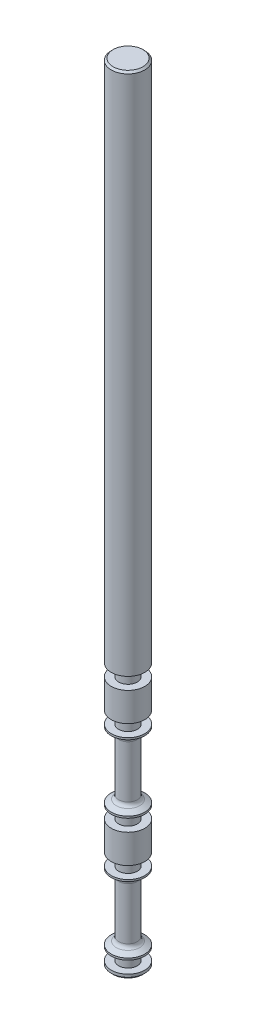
ISO-10303-21;
HEADER;
FILE_DESCRIPTION(('STEP AP214'),'2;1');
FILE_NAME('part.step','',(''),(''),'','','');
FILE_SCHEMA(('AUTOMOTIVE_DESIGN { 1 0 10303 214 1 1 1 1 }'));
ENDSEC;
DATA;
#1=APPLICATION_CONTEXT('core data for automotive mechanical design processes');
#2=APPLICATION_PROTOCOL_DEFINITION('international standard','automotive_design',2000,#1);
#3=PRODUCT_CONTEXT('',#1,'mechanical');
#4=PRODUCT('Part','Part','',(#3));
#5=PRODUCT_RELATED_PRODUCT_CATEGORY('part','',(#4));
#6=PRODUCT_DEFINITION_FORMATION('','',#4);
#7=PRODUCT_DEFINITION_CONTEXT('part definition',#1,'design');
#8=PRODUCT_DEFINITION('design','',#6,#7);
#9=PRODUCT_DEFINITION_SHAPE('','',#8);
#10=(LENGTH_UNIT() NAMED_UNIT(*) SI_UNIT(.MILLI.,.METRE.));
#11=(NAMED_UNIT(*) PLANE_ANGLE_UNIT() SI_UNIT($,.RADIAN.));
#12=(NAMED_UNIT(*) SI_UNIT($,.STERADIAN.) SOLID_ANGLE_UNIT());
#13=UNCERTAINTY_MEASURE_WITH_UNIT(LENGTH_MEASURE(1.E-05),#10,'distance_accuracy_value','');
#14=(GEOMETRIC_REPRESENTATION_CONTEXT(3) GLOBAL_UNCERTAINTY_ASSIGNED_CONTEXT((#13)) GLOBAL_UNIT_ASSIGNED_CONTEXT((#10,
#11,#12)) REPRESENTATION_CONTEXT('',''));
#15=CARTESIAN_POINT('',(0.,0.,0.));
#16=DIRECTION('',(0.,0.,1.));
#17=DIRECTION('',(1.,0.,0.));
#18=AXIS2_PLACEMENT_3D('',#15,#16,#17);
#19=CARTESIAN_POINT('',(56.,-1067.65754338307,0.5));
#20=DIRECTION('',(0.,-1.,0.));
#21=DIRECTION('',(0.,0.,-1.));
#22=AXIS2_PLACEMENT_3D('',#19,#20,#21);
#23=CYLINDRICAL_SURFACE('',#22,1.80000000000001);
#24=CARTESIAN_POINT('',(56.,-59.9499999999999,0.5));
#25=DIRECTION('',(0.,-1.,0.));
#26=DIRECTION('',(0.,0.,-1.));
#27=AXIS2_PLACEMENT_3D('',#24,#25,#26);
#28=CIRCLE('',#27,1.80000000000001);
#29=CARTESIAN_POINT('',(56.,-59.9499999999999,-1.30000000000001));
#30=VERTEX_POINT('',#29);
#31=EDGE_CURVE('E144',#30,#30,#28,.T.);
#32=ORIENTED_EDGE('',*,*,#31,.T.);
#33=EDGE_LOOP('',(#32));
#34=FACE_BOUND('',#33,.T.);
#35=CARTESIAN_POINT('',(56.,-63.0500000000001,0.5));
#36=DIRECTION('',(0.,-1.,0.));
#37=DIRECTION('',(0.,0.,-1.));
#38=AXIS2_PLACEMENT_3D('',#35,#36,#37);
#39=CIRCLE('',#38,1.80000000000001);
#40=CARTESIAN_POINT('',(56.,-63.0500000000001,-1.30000000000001));
#41=VERTEX_POINT('',#40);
#42=EDGE_CURVE('E75',#41,#41,#39,.T.);
#43=ORIENTED_EDGE('',*,*,#42,.F.);
#44=EDGE_LOOP('',(#43));
#45=FACE_BOUND('',#44,.T.);
#46=ADVANCED_FACE('F31',(#34,#45),#23,.T.);
#47=CARTESIAN_POINT('',(57.8,-63.05,0.5));
#48=DIRECTION('',(0.,-1.,0.));
#49=DIRECTION('',(0.,0.,-1.));
#50=AXIS2_PLACEMENT_3D('',#47,#48,#49);
#51=PLANE('',#50);
#52=ORIENTED_EDGE('',*,*,#42,.T.);
#53=EDGE_LOOP('',(#52));
#54=FACE_BOUND('',#53,.T.);
#55=CARTESIAN_POINT('',(56.,-63.0500000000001,0.5));
#56=DIRECTION('',(0.,-1.,0.));
#57=DIRECTION('',(0.,0.,-1.));
#58=AXIS2_PLACEMENT_3D('',#55,#56,#57);
#59=CIRCLE('',#58,1.);
#60=CARTESIAN_POINT('',(56.,-63.0500000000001,-0.500000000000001));
#61=VERTEX_POINT('',#60);
#62=EDGE_CURVE('E78',#61,#61,#59,.T.);
#63=ORIENTED_EDGE('',*,*,#62,.F.);
#64=EDGE_LOOP('',(#63));
#65=FACE_BOUND('',#64,.T.);
#66=ADVANCED_FACE('F167',(#54,#65),#51,.T.);
#67=CARTESIAN_POINT('',(56.,-1067.65754338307,0.5));
#68=DIRECTION('',(0.,-1.,0.));
#69=DIRECTION('',(0.,0.,-1.));
#70=AXIS2_PLACEMENT_3D('',#67,#68,#69);
#71=CYLINDRICAL_SURFACE('',#70,1.);
#72=ORIENTED_EDGE('',*,*,#62,.T.);
#73=EDGE_LOOP('',(#72));
#74=FACE_BOUND('',#73,.T.);
#75=CARTESIAN_POINT('',(56.,-64.3499999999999,0.5));
#76=DIRECTION('',(0.,-1.,0.));
#77=DIRECTION('',(0.,0.,-1.));
#78=AXIS2_PLACEMENT_3D('',#75,#76,#77);
#79=CIRCLE('',#78,1.);
#80=CARTESIAN_POINT('',(56.,-64.3499999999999,-0.500000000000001));
#81=VERTEX_POINT('',#80);
#82=EDGE_CURVE('E81',#81,#81,#79,.T.);
#83=ORIENTED_EDGE('',*,*,#82,.F.);
#84=EDGE_LOOP('',(#83));
#85=FACE_BOUND('',#84,.T.);
#86=ADVANCED_FACE('F172',(#74,#85),#71,.T.);
#87=CARTESIAN_POINT('',(57.,-64.35,0.5));
#88=DIRECTION('',(0.,1.,0.));
#89=DIRECTION('',(0.,0.,1.));
#90=AXIS2_PLACEMENT_3D('',#87,#88,#89);
#91=PLANE('',#90);
#92=ORIENTED_EDGE('',*,*,#82,.T.);
#93=EDGE_LOOP('',(#92));
#94=FACE_BOUND('',#93,.T.);
#95=CARTESIAN_POINT('',(56.,-64.3499999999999,0.5));
#96=DIRECTION('',(0.,-1.,0.));
#97=DIRECTION('',(0.,0.,-1.));
#98=AXIS2_PLACEMENT_3D('',#95,#96,#97);
#99=CIRCLE('',#98,1.80000000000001);
#100=CARTESIAN_POINT('',(56.,-64.3499999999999,-1.30000000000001));
#101=VERTEX_POINT('',#100);
#102=EDGE_CURVE('E84',#101,#101,#99,.T.);
#103=ORIENTED_EDGE('',*,*,#102,.F.);
#104=EDGE_LOOP('',(#103));
#105=FACE_BOUND('',#104,.T.);
#106=ADVANCED_FACE('F279',(#94,#105),#91,.T.);
#107=CARTESIAN_POINT('',(56.,-1067.65754338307,0.5));
#108=DIRECTION('',(0.,-1.,0.));
#109=DIRECTION('',(0.,0.,-1.));
#110=AXIS2_PLACEMENT_3D('',#107,#108,#109);
#111=CYLINDRICAL_SURFACE('',#110,1.80000000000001);
#112=ORIENTED_EDGE('',*,*,#102,.T.);
#113=EDGE_LOOP('',(#112));
#114=FACE_BOUND('',#113,.T.);
#115=CARTESIAN_POINT('',(56.,-64.5499999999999,0.5));
#116=DIRECTION('',(0.,-1.,0.));
#117=DIRECTION('',(0.,0.,-1.));
#118=AXIS2_PLACEMENT_3D('',#115,#116,#117);
#119=CIRCLE('',#118,1.80000000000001);
#120=CARTESIAN_POINT('',(56.,-64.5499999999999,-1.30000000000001));
#121=VERTEX_POINT('',#120);
#122=EDGE_CURVE('E87',#121,#121,#119,.T.);
#123=ORIENTED_EDGE('',*,*,#122,.F.);
#124=EDGE_LOOP('',(#123));
#125=FACE_BOUND('',#124,.T.);
#126=ADVANCED_FACE('F276',(#114,#125),#111,.T.);
#127=CARTESIAN_POINT('',(56.,-65.0118802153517,0.5));
#128=DIRECTION('',(0.,1.,0.));
#129=DIRECTION('',(0.,0.,1.));
#130=AXIS2_PLACEMENT_3D('',#127,#128,#129);
#131=CONICAL_SURFACE('',#130,1.,1.04719755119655);
#132=CARTESIAN_POINT('',(56.,-64.8675426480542,0.5));
#133=DIRECTION('',(0.,1.,0.));
#134=DIRECTION('',(0.,0.,1.));
#135=AXIS2_PLACEMENT_3D('',#132,#133,#134);
#136=CIRCLE('',#135,1.25);
#137=CARTESIAN_POINT('',(56.,-64.8675426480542,1.75));
#138=VERTEX_POINT('',#137);
#139=EDGE_CURVE('E10',#138,#138,#136,.T.);
#140=ORIENTED_EDGE('',*,*,#139,.T.);
#141=EDGE_LOOP('',(#140));
#142=FACE_BOUND('',#141,.T.);
#143=ORIENTED_EDGE('',*,*,#122,.T.);
#144=EDGE_LOOP('',(#143));
#145=FACE_BOUND('',#144,.T.);
#146=ADVANCED_FACE('F273',(#142,#145),#131,.T.);
#147=CARTESIAN_POINT('',(56.,-1067.65754338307,0.5));
#148=DIRECTION('',(0.,-1.,0.));
#149=DIRECTION('',(0.,0.,-1.));
#150=AXIS2_PLACEMENT_3D('',#147,#148,#149);
#151=CYLINDRICAL_SURFACE('',#150,1.);
#152=CARTESIAN_POINT('',(56.,-70.8994446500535,0.5));
#153=DIRECTION('',(0.,-1.,0.));
#154=DIRECTION('',(0.,0.,-1.));
#155=AXIS2_PLACEMENT_3D('',#152,#153,#154);
#156=CIRCLE('',#155,1.);
#157=CARTESIAN_POINT('',(56.,-70.8994446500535,-0.500000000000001));
#158=VERTEX_POINT('',#157);
#159=EDGE_CURVE('E38',#158,#158,#156,.F.);
#160=ORIENTED_EDGE('',*,*,#159,.T.);
#161=EDGE_LOOP('',(#160));
#162=FACE_BOUND('',#161,.T.);
#163=CARTESIAN_POINT('',(56.,-65.3005553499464,0.5));
#164=DIRECTION('',(0.,-1.,0.));
#165=DIRECTION('',(0.,0.,-1.));
#166=AXIS2_PLACEMENT_3D('',#163,#164,#165);
#167=CIRCLE('',#166,1.);
#168=CARTESIAN_POINT('',(56.,-65.3005553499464,-0.500000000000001));
#169=VERTEX_POINT('',#168);
#170=EDGE_CURVE('E42',#169,#169,#167,.T.);
#171=ORIENTED_EDGE('',*,*,#170,.T.);
#172=EDGE_LOOP('',(#171));
#173=FACE_BOUND('',#172,.T.);
#174=ADVANCED_FACE('F201',(#162,#173),#151,.T.);
#175=CARTESIAN_POINT('',(56.,-71.65,0.5));
#176=DIRECTION('',(0.,-1.,0.));
#177=DIRECTION('',(0.,0.,-1.));
#178=AXIS2_PLACEMENT_3D('',#175,#176,#177);
#179=CONICAL_SURFACE('',#178,1.8,1.04719755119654);
#180=CARTESIAN_POINT('',(56.,-71.3324573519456,0.5));
#181=DIRECTION('',(0.,-1.,0.));
#182=DIRECTION('',(0.,0.,-1.));
#183=AXIS2_PLACEMENT_3D('',#180,#181,#182);
#184=CIRCLE('',#183,1.25);
#185=CARTESIAN_POINT('',(56.,-71.3324573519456,-0.750000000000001));
#186=VERTEX_POINT('',#185);
#187=EDGE_CURVE('E46',#186,#186,#184,.T.);
#188=ORIENTED_EDGE('',*,*,#187,.T.);
#189=EDGE_LOOP('',(#188));
#190=FACE_BOUND('',#189,.T.);
#191=CARTESIAN_POINT('',(56.,-71.65,0.5));
#192=DIRECTION('',(0.,-1.,0.));
#193=DIRECTION('',(0.,0.,-1.));
#194=AXIS2_PLACEMENT_3D('',#191,#192,#193);
#195=CIRCLE('',#194,1.8);
#196=CARTESIAN_POINT('',(56.,-71.65,-1.3));
#197=VERTEX_POINT('',#196);
#198=EDGE_CURVE('E90',#197,#197,#195,.T.);
#199=ORIENTED_EDGE('',*,*,#198,.F.);
#200=EDGE_LOOP('',(#199));
#201=FACE_BOUND('',#200,.T.);
#202=ADVANCED_FACE('F197',(#190,#201),#179,.T.);
#203=CARTESIAN_POINT('',(56.,-1067.65754338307,0.5));
#204=DIRECTION('',(0.,-1.,0.));
#205=DIRECTION('',(0.,0.,-1.));
#206=AXIS2_PLACEMENT_3D('',#203,#204,#205);
#207=CYLINDRICAL_SURFACE('',#206,1.80000000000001);
#208=ORIENTED_EDGE('',*,*,#198,.T.);
#209=EDGE_LOOP('',(#208));
#210=FACE_BOUND('',#209,.T.);
#211=CARTESIAN_POINT('',(56.,-71.85,0.5));
#212=DIRECTION('',(0.,-1.,0.));
#213=DIRECTION('',(0.,0.,-1.));
#214=AXIS2_PLACEMENT_3D('',#211,#212,#213);
#215=CIRCLE('',#214,1.80000000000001);
#216=CARTESIAN_POINT('',(56.,-71.85,-1.30000000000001));
#217=VERTEX_POINT('',#216);
#218=EDGE_CURVE('E93',#217,#217,#215,.T.);
#219=ORIENTED_EDGE('',*,*,#218,.F.);
#220=EDGE_LOOP('',(#219));
#221=FACE_BOUND('',#220,.T.);
#222=ADVANCED_FACE('F200',(#210,#221),#207,.T.);
#223=CARTESIAN_POINT('',(57.8,-71.85,0.5));
#224=DIRECTION('',(0.,-1.,0.));
#225=DIRECTION('',(0.,0.,-1.));
#226=AXIS2_PLACEMENT_3D('',#223,#224,#225);
#227=PLANE('',#226);
#228=ORIENTED_EDGE('',*,*,#218,.T.);
#229=EDGE_LOOP('',(#228));
#230=FACE_BOUND('',#229,.T.);
#231=CARTESIAN_POINT('',(56.,-71.85,0.5));
#232=DIRECTION('',(0.,-1.,0.));
#233=DIRECTION('',(0.,0.,-1.));
#234=AXIS2_PLACEMENT_3D('',#231,#232,#233);
#235=CIRCLE('',#234,1.);
#236=CARTESIAN_POINT('',(56.,-71.85,-0.500000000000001));
#237=VERTEX_POINT('',#236);
#238=EDGE_CURVE('E96',#237,#237,#235,.T.);
#239=ORIENTED_EDGE('',*,*,#238,.F.);
#240=EDGE_LOOP('',(#239));
#241=FACE_BOUND('',#240,.T.);
#242=ADVANCED_FACE('F207',(#230,#241),#227,.T.);
#243=CARTESIAN_POINT('',(56.,-1067.65754338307,0.5));
#244=DIRECTION('',(0.,-1.,0.));
#245=DIRECTION('',(0.,0.,-1.));
#246=AXIS2_PLACEMENT_3D('',#243,#244,#245);
#247=CYLINDRICAL_SURFACE('',#246,1.);
#248=ORIENTED_EDGE('',*,*,#238,.T.);
#249=EDGE_LOOP('',(#248));
#250=FACE_BOUND('',#249,.T.);
#251=CARTESIAN_POINT('',(56.,-73.1499999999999,0.5));
#252=DIRECTION('',(0.,-1.,0.));
#253=DIRECTION('',(0.,0.,-1.));
#254=AXIS2_PLACEMENT_3D('',#251,#252,#253);
#255=CIRCLE('',#254,1.);
#256=CARTESIAN_POINT('',(56.,-73.1499999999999,-0.500000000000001));
#257=VERTEX_POINT('',#256);
#258=EDGE_CURVE('E99',#257,#257,#255,.T.);
#259=ORIENTED_EDGE('',*,*,#258,.F.);
#260=EDGE_LOOP('',(#259));
#261=FACE_BOUND('',#260,.T.);
#262=ADVANCED_FACE('F213',(#250,#261),#247,.T.);
#263=CARTESIAN_POINT('',(57.,-73.15,0.5));
#264=DIRECTION('',(0.,1.,0.));
#265=DIRECTION('',(0.,0.,1.));
#266=AXIS2_PLACEMENT_3D('',#263,#264,#265);
#267=PLANE('',#266);
#268=ORIENTED_EDGE('',*,*,#258,.T.);
#269=EDGE_LOOP('',(#268));
#270=FACE_BOUND('',#269,.T.);
#271=CARTESIAN_POINT('',(56.,-73.15,0.5));
#272=DIRECTION('',(0.,-1.,0.));
#273=DIRECTION('',(0.,0.,-1.));
#274=AXIS2_PLACEMENT_3D('',#271,#272,#273);
#275=CIRCLE('',#274,1.80000000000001);
#276=CARTESIAN_POINT('',(56.,-73.15,-1.30000000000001));
#277=VERTEX_POINT('',#276);
#278=EDGE_CURVE('E102',#277,#277,#275,.T.);
#279=ORIENTED_EDGE('',*,*,#278,.F.);
#280=EDGE_LOOP('',(#279));
#281=FACE_BOUND('',#280,.T.);
#282=ADVANCED_FACE('F219',(#270,#281),#267,.T.);
#283=CARTESIAN_POINT('',(56.,-1067.65754338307,0.5));
#284=DIRECTION('',(0.,-1.,0.));
#285=DIRECTION('',(0.,0.,-1.));
#286=AXIS2_PLACEMENT_3D('',#283,#284,#285);
#287=CYLINDRICAL_SURFACE('',#286,1.80000000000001);
#288=ORIENTED_EDGE('',*,*,#278,.T.);
#289=EDGE_LOOP('',(#288));
#290=FACE_BOUND('',#289,.T.);
#291=CARTESIAN_POINT('',(56.,-76.25,0.5));
#292=DIRECTION('',(0.,-1.,0.));
#293=DIRECTION('',(0.,0.,-1.));
#294=AXIS2_PLACEMENT_3D('',#291,#292,#293);
#295=CIRCLE('',#294,1.80000000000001);
#296=CARTESIAN_POINT('',(56.,-76.25,-1.30000000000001));
#297=VERTEX_POINT('',#296);
#298=EDGE_CURVE('E105',#297,#297,#295,.T.);
#299=ORIENTED_EDGE('',*,*,#298,.F.);
#300=EDGE_LOOP('',(#299));
#301=FACE_BOUND('',#300,.T.);
#302=ADVANCED_FACE('F225',(#290,#301),#287,.T.);
#303=CARTESIAN_POINT('',(57.8,-76.25,0.5));
#304=DIRECTION('',(0.,-1.,0.));
#305=DIRECTION('',(0.,0.,-1.));
#306=AXIS2_PLACEMENT_3D('',#303,#304,#305);
#307=PLANE('',#306);
#308=ORIENTED_EDGE('',*,*,#298,.T.);
#309=EDGE_LOOP('',(#308));
#310=FACE_BOUND('',#309,.T.);
#311=CARTESIAN_POINT('',(56.,-76.25,0.5));
#312=DIRECTION('',(0.,-1.,0.));
#313=DIRECTION('',(0.,0.,-1.));
#314=AXIS2_PLACEMENT_3D('',#311,#312,#313);
#315=CIRCLE('',#314,1.);
#316=CARTESIAN_POINT('',(56.,-76.25,-0.500000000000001));
#317=VERTEX_POINT('',#316);
#318=EDGE_CURVE('E108',#317,#317,#315,.T.);
#319=ORIENTED_EDGE('',*,*,#318,.F.);
#320=EDGE_LOOP('',(#319));
#321=FACE_BOUND('',#320,.T.);
#322=ADVANCED_FACE('F231',(#310,#321),#307,.T.);
#323=CARTESIAN_POINT('',(56.,-1067.65754338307,0.5));
#324=DIRECTION('',(0.,-1.,0.));
#325=DIRECTION('',(0.,0.,-1.));
#326=AXIS2_PLACEMENT_3D('',#323,#324,#325);
#327=CYLINDRICAL_SURFACE('',#326,1.);
#328=ORIENTED_EDGE('',*,*,#318,.T.);
#329=EDGE_LOOP('',(#328));
#330=FACE_BOUND('',#329,.T.);
#331=CARTESIAN_POINT('',(56.,-77.55,0.5));
#332=DIRECTION('',(0.,-1.,0.));
#333=DIRECTION('',(0.,0.,-1.));
#334=AXIS2_PLACEMENT_3D('',#331,#332,#333);
#335=CIRCLE('',#334,1.);
#336=CARTESIAN_POINT('',(56.,-77.55,-0.500000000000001));
#337=VERTEX_POINT('',#336);
#338=EDGE_CURVE('E111',#337,#337,#335,.T.);
#339=ORIENTED_EDGE('',*,*,#338,.F.);
#340=EDGE_LOOP('',(#339));
#341=FACE_BOUND('',#340,.T.);
#342=ADVANCED_FACE('F237',(#330,#341),#327,.T.);
#343=CARTESIAN_POINT('',(57.,-77.55,0.5));
#344=DIRECTION('',(0.,1.,0.));
#345=DIRECTION('',(0.,0.,1.));
#346=AXIS2_PLACEMENT_3D('',#343,#344,#345);
#347=PLANE('',#346);
#348=ORIENTED_EDGE('',*,*,#338,.T.);
#349=EDGE_LOOP('',(#348));
#350=FACE_BOUND('',#349,.T.);
#351=CARTESIAN_POINT('',(56.,-77.55,0.5));
#352=DIRECTION('',(0.,-1.,0.));
#353=DIRECTION('',(0.,0.,-1.));
#354=AXIS2_PLACEMENT_3D('',#351,#352,#353);
#355=CIRCLE('',#354,1.80000000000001);
#356=CARTESIAN_POINT('',(56.,-77.55,-1.30000000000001));
#357=VERTEX_POINT('',#356);
#358=EDGE_CURVE('E114',#357,#357,#355,.T.);
#359=ORIENTED_EDGE('',*,*,#358,.F.);
#360=EDGE_LOOP('',(#359));
#361=FACE_BOUND('',#360,.T.);
#362=ADVANCED_FACE('F243',(#350,#361),#347,.T.);
#363=CARTESIAN_POINT('',(56.,-1067.65754338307,0.5));
#364=DIRECTION('',(0.,-1.,0.));
#365=DIRECTION('',(0.,0.,-1.));
#366=AXIS2_PLACEMENT_3D('',#363,#364,#365);
#367=CYLINDRICAL_SURFACE('',#366,1.80000000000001);
#368=ORIENTED_EDGE('',*,*,#358,.T.);
#369=EDGE_LOOP('',(#368));
#370=FACE_BOUND('',#369,.T.);
#371=CARTESIAN_POINT('',(56.,-77.75,0.5));
#372=DIRECTION('',(0.,-1.,0.));
#373=DIRECTION('',(0.,0.,-1.));
#374=AXIS2_PLACEMENT_3D('',#371,#372,#373);
#375=CIRCLE('',#374,1.80000000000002);
#376=CARTESIAN_POINT('',(56.,-77.75,-1.30000000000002));
#377=VERTEX_POINT('',#376);
#378=EDGE_CURVE('E117',#377,#377,#375,.T.);
#379=ORIENTED_EDGE('',*,*,#378,.F.);
#380=EDGE_LOOP('',(#379));
#381=FACE_BOUND('',#380,.T.);
#382=ADVANCED_FACE('F249',(#370,#381),#367,.T.);
#383=CARTESIAN_POINT('',(56.,-78.2118802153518,0.5));
#384=DIRECTION('',(0.,1.,0.));
#385=DIRECTION('',(0.,0.,1.));
#386=AXIS2_PLACEMENT_3D('',#383,#384,#385);
#387=CONICAL_SURFACE('',#386,1.,1.04719755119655);
#388=CARTESIAN_POINT('',(56.,-78.0675426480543,0.5));
#389=DIRECTION('',(0.,1.,0.));
#390=DIRECTION('',(0.,0.,1.));
#391=AXIS2_PLACEMENT_3D('',#388,#389,#390);
#392=CIRCLE('',#391,1.25);
#393=CARTESIAN_POINT('',(56.,-78.0675426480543,1.75));
#394=VERTEX_POINT('',#393);
#395=EDGE_CURVE('E51',#394,#394,#392,.T.);
#396=ORIENTED_EDGE('',*,*,#395,.T.);
#397=EDGE_LOOP('',(#396));
#398=FACE_BOUND('',#397,.T.);
#399=ORIENTED_EDGE('',*,*,#378,.T.);
#400=EDGE_LOOP('',(#399));
#401=FACE_BOUND('',#400,.T.);
#402=ADVANCED_FACE('F255',(#398,#401),#387,.T.);
#403=CARTESIAN_POINT('',(56.,-1067.65754338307,0.5));
#404=DIRECTION('',(0.,-1.,0.));
#405=DIRECTION('',(0.,0.,-1.));
#406=AXIS2_PLACEMENT_3D('',#403,#404,#405);
#407=CYLINDRICAL_SURFACE('',#406,1.);
#408=CARTESIAN_POINT('',(56.,-84.0994446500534,0.5));
#409=DIRECTION('',(0.,-1.,0.));
#410=DIRECTION('',(0.,0.,-1.));
#411=AXIS2_PLACEMENT_3D('',#408,#409,#410);
#412=CIRCLE('',#411,1.);
#413=CARTESIAN_POINT('',(56.,-84.0994446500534,-0.500000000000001));
#414=VERTEX_POINT('',#413);
#415=EDGE_CURVE('E54',#414,#414,#412,.F.);
#416=ORIENTED_EDGE('',*,*,#415,.T.);
#417=EDGE_LOOP('',(#416));
#418=FACE_BOUND('',#417,.T.);
#419=CARTESIAN_POINT('',(56.,-78.5005553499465,0.5));
#420=DIRECTION('',(0.,-1.,0.));
#421=DIRECTION('',(0.,0.,-1.));
#422=AXIS2_PLACEMENT_3D('',#419,#420,#421);
#423=CIRCLE('',#422,1.);
#424=CARTESIAN_POINT('',(56.,-78.5005553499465,-0.500000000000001));
#425=VERTEX_POINT('',#424);
#426=EDGE_CURVE('E57',#425,#425,#423,.T.);
#427=ORIENTED_EDGE('',*,*,#426,.T.);
#428=EDGE_LOOP('',(#427));
#429=FACE_BOUND('',#428,.T.);
#430=ADVANCED_FACE('F260',(#418,#429),#407,.T.);
#431=CARTESIAN_POINT('',(56.,-84.85,0.5));
#432=DIRECTION('',(0.,-1.,0.));
#433=DIRECTION('',(0.,0.,-1.));
#434=AXIS2_PLACEMENT_3D('',#431,#432,#433);
#435=CONICAL_SURFACE('',#434,1.80000000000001,1.04719755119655);
#436=CARTESIAN_POINT('',(56.,-84.5324573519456,0.5));
#437=DIRECTION('',(0.,-1.,0.));
#438=DIRECTION('',(0.,0.,-1.));
#439=AXIS2_PLACEMENT_3D('',#436,#437,#438);
#440=CIRCLE('',#439,1.24999999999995);
#441=CARTESIAN_POINT('',(56.,-84.5324573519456,-0.749999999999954));
#442=VERTEX_POINT('',#441);
#443=EDGE_CURVE('E60',#442,#442,#440,.T.);
#444=ORIENTED_EDGE('',*,*,#443,.T.);
#445=EDGE_LOOP('',(#444));
#446=FACE_BOUND('',#445,.T.);
#447=CARTESIAN_POINT('',(56.,-84.85,0.5));
#448=DIRECTION('',(0.,-1.,0.));
#449=DIRECTION('',(0.,0.,-1.));
#450=AXIS2_PLACEMENT_3D('',#447,#448,#449);
#451=CIRCLE('',#450,1.80000000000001);
#452=CARTESIAN_POINT('',(56.,-84.85,-1.30000000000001));
#453=VERTEX_POINT('',#452);
#454=EDGE_CURVE('E120',#453,#453,#451,.T.);
#455=ORIENTED_EDGE('',*,*,#454,.F.);
#456=EDGE_LOOP('',(#455));
#457=FACE_BOUND('',#456,.T.);
#458=ADVANCED_FACE('F266',(#446,#457),#435,.T.);
#459=CARTESIAN_POINT('',(56.,-1067.65754338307,0.5));
#460=DIRECTION('',(0.,-1.,0.));
#461=DIRECTION('',(0.,0.,-1.));
#462=AXIS2_PLACEMENT_3D('',#459,#460,#461);
#463=CYLINDRICAL_SURFACE('',#462,1.80000000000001);
#464=ORIENTED_EDGE('',*,*,#454,.T.);
#465=EDGE_LOOP('',(#464));
#466=FACE_BOUND('',#465,.T.);
#467=CARTESIAN_POINT('',(56.,-85.05,0.5));
#468=DIRECTION('',(0.,-1.,0.));
#469=DIRECTION('',(0.,0.,-1.));
#470=AXIS2_PLACEMENT_3D('',#467,#468,#469);
#471=CIRCLE('',#470,1.80000000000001);
#472=CARTESIAN_POINT('',(56.,-85.05,-1.30000000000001));
#473=VERTEX_POINT('',#472);
#474=EDGE_CURVE('E123',#473,#473,#471,.T.);
#475=ORIENTED_EDGE('',*,*,#474,.F.);
#476=EDGE_LOOP('',(#475));
#477=FACE_BOUND('',#476,.T.);
#478=ADVANCED_FACE('F361',(#466,#477),#463,.T.);
#479=CARTESIAN_POINT('',(57.8,-85.05,0.5));
#480=DIRECTION('',(0.,-1.,0.));
#481=DIRECTION('',(0.,0.,-1.));
#482=AXIS2_PLACEMENT_3D('',#479,#480,#481);
#483=PLANE('',#482);
#484=ORIENTED_EDGE('',*,*,#474,.T.);
#485=EDGE_LOOP('',(#484));
#486=FACE_BOUND('',#485,.T.);
#487=CARTESIAN_POINT('',(56.,-85.05,0.5));
#488=DIRECTION('',(0.,-1.,0.));
#489=DIRECTION('',(0.,0.,-1.));
#490=AXIS2_PLACEMENT_3D('',#487,#488,#489);
#491=CIRCLE('',#490,1.);
#492=CARTESIAN_POINT('',(56.,-85.05,-0.500000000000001));
#493=VERTEX_POINT('',#492);
#494=EDGE_CURVE('E126',#493,#493,#491,.T.);
#495=ORIENTED_EDGE('',*,*,#494,.F.);
#496=EDGE_LOOP('',(#495));
#497=FACE_BOUND('',#496,.T.);
#498=ADVANCED_FACE('F366',(#486,#497),#483,.T.);
#499=CARTESIAN_POINT('',(56.,-1067.65754338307,0.5));
#500=DIRECTION('',(0.,-1.,0.));
#501=DIRECTION('',(0.,0.,-1.));
#502=AXIS2_PLACEMENT_3D('',#499,#500,#501);
#503=CYLINDRICAL_SURFACE('',#502,1.);
#504=ORIENTED_EDGE('',*,*,#494,.T.);
#505=EDGE_LOOP('',(#504));
#506=FACE_BOUND('',#505,.T.);
#507=CARTESIAN_POINT('',(56.,-86.35,0.5));
#508=DIRECTION('',(0.,-1.,0.));
#509=DIRECTION('',(0.,0.,-1.));
#510=AXIS2_PLACEMENT_3D('',#507,#508,#509);
#511=CIRCLE('',#510,1.);
#512=CARTESIAN_POINT('',(56.,-86.35,-0.500000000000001));
#513=VERTEX_POINT('',#512);
#514=EDGE_CURVE('E129',#513,#513,#511,.T.);
#515=ORIENTED_EDGE('',*,*,#514,.F.);
#516=EDGE_LOOP('',(#515));
#517=FACE_BOUND('',#516,.T.);
#518=ADVANCED_FACE('F378',(#506,#517),#503,.T.);
#519=CARTESIAN_POINT('',(57.,-86.35,0.5));
#520=DIRECTION('',(0.,1.,0.));
#521=DIRECTION('',(0.,0.,1.));
#522=AXIS2_PLACEMENT_3D('',#519,#520,#521);
#523=PLANE('',#522);
#524=ORIENTED_EDGE('',*,*,#514,.T.);
#525=EDGE_LOOP('',(#524));
#526=FACE_BOUND('',#525,.T.);
#527=CARTESIAN_POINT('',(56.,-86.35,0.5));
#528=DIRECTION('',(0.,-1.,0.));
#529=DIRECTION('',(0.,0.,-1.));
#530=AXIS2_PLACEMENT_3D('',#527,#528,#529);
#531=CIRCLE('',#530,1.80000000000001);
#532=CARTESIAN_POINT('',(56.,-86.35,-1.30000000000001));
#533=VERTEX_POINT('',#532);
#534=EDGE_CURVE('E132',#533,#533,#531,.T.);
#535=ORIENTED_EDGE('',*,*,#534,.F.);
#536=EDGE_LOOP('',(#535));
#537=FACE_BOUND('',#536,.T.);
#538=ADVANCED_FACE('F388',(#526,#537),#523,.T.);
#539=CARTESIAN_POINT('',(56.,-1067.65754338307,0.5));
#540=DIRECTION('',(0.,-1.,0.));
#541=DIRECTION('',(0.,0.,-1.));
#542=AXIS2_PLACEMENT_3D('',#539,#540,#541);
#543=CYLINDRICAL_SURFACE('',#542,1.80000000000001);
#544=CARTESIAN_POINT('',(56.,-86.65,0.5));
#545=DIRECTION('',(0.,-1.,0.));
#546=DIRECTION('',(0.,0.,-1.));
#547=AXIS2_PLACEMENT_3D('',#544,#545,#546);
#548=CIRCLE('',#547,1.80000000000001);
#549=CARTESIAN_POINT('',(56.,-86.65,2.30000000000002));
#550=VERTEX_POINT('',#549);
#551=EDGE_CURVE('E69',#550,#550,#548,.F.);
#552=ORIENTED_EDGE('',*,*,#551,.T.);
#553=EDGE_LOOP('',(#552));
#554=FACE_BOUND('',#553,.T.);
#555=ORIENTED_EDGE('',*,*,#534,.T.);
#556=EDGE_LOOP('',(#555));
#557=FACE_BOUND('',#556,.T.);
#558=ADVANCED_FACE('F398',(#554,#557),#543,.T.);
#559=CARTESIAN_POINT('',(57.8,-86.85,0.5));
#560=DIRECTION('',(0.,-1.,0.));
#561=DIRECTION('',(0.,0.,-1.));
#562=AXIS2_PLACEMENT_3D('',#559,#560,#561);
#563=PLANE('',#562);
#564=CARTESIAN_POINT('',(56.,-86.85,0.5));
#565=DIRECTION('',(0.,-1.,0.));
#566=DIRECTION('',(0.,0.,-1.));
#567=AXIS2_PLACEMENT_3D('',#564,#565,#566);
#568=CIRCLE('',#567,1.60000000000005);
#569=CARTESIAN_POINT('',(56.,-86.85,2.10000000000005));
#570=VERTEX_POINT('',#569);
#571=EDGE_CURVE('E72',#570,#570,#568,.T.);
#572=ORIENTED_EDGE('',*,*,#571,.T.);
#573=EDGE_LOOP('',(#572));
#574=FACE_BOUND('',#573,.T.);
#575=ADVANCED_FACE('F431',(#574),#563,.T.);
#576=CARTESIAN_POINT('',(56.,-2.4,0.5));
#577=DIRECTION('',(0.,1.,0.));
#578=DIRECTION('',(0.,0.,1.));
#579=AXIS2_PLACEMENT_3D('',#576,#577,#578);
#580=PLANE('',#579);
#581=CARTESIAN_POINT('',(56.,-2.4,0.5));
#582=DIRECTION('',(0.,1.,0.));
#583=DIRECTION('',(0.,0.,1.));
#584=AXIS2_PLACEMENT_3D('',#581,#582,#583);
#585=CIRCLE('',#584,1.6000000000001);
#586=CARTESIAN_POINT('',(56.,-2.4,-1.1000000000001));
#587=VERTEX_POINT('',#586);
#588=EDGE_CURVE('E63',#587,#587,#585,.T.);
#589=ORIENTED_EDGE('',*,*,#588,.T.);
#590=EDGE_LOOP('',(#589));
#591=FACE_BOUND('',#590,.T.);
#592=ADVANCED_FACE('F441',(#591),#580,.T.);
#593=CARTESIAN_POINT('',(56.,-1067.65754338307,0.5));
#594=DIRECTION('',(0.,-1.,0.));
#595=DIRECTION('',(0.,0.,-1.));
#596=AXIS2_PLACEMENT_3D('',#593,#594,#595);
#597=CYLINDRICAL_SURFACE('',#596,1.80000000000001);
#598=CARTESIAN_POINT('',(56.,-2.59999999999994,0.5));
#599=DIRECTION('',(0.,1.,0.));
#600=DIRECTION('',(0.,0.,1.));
#601=AXIS2_PLACEMENT_3D('',#598,#599,#600);
#602=CIRCLE('',#601,1.80000000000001);
#603=CARTESIAN_POINT('',(56.,-2.59999999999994,-1.30000000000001));
#604=VERTEX_POINT('',#603);
#605=EDGE_CURVE('E66',#604,#604,#602,.F.);
#606=ORIENTED_EDGE('',*,*,#605,.T.);
#607=EDGE_LOOP('',(#606));
#608=FACE_BOUND('',#607,.T.);
#609=CARTESIAN_POINT('',(56.,-58.6500000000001,0.5));
#610=DIRECTION('',(0.,-1.,0.));
#611=DIRECTION('',(0.,0.,-1.));
#612=AXIS2_PLACEMENT_3D('',#609,#610,#611);
#613=CIRCLE('',#612,1.80000000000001);
#614=CARTESIAN_POINT('',(56.,-58.6500000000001,-1.30000000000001));
#615=VERTEX_POINT('',#614);
#616=EDGE_CURVE('E135',#615,#615,#613,.T.);
#617=ORIENTED_EDGE('',*,*,#616,.F.);
#618=EDGE_LOOP('',(#617));
#619=FACE_BOUND('',#618,.T.);
#620=ADVANCED_FACE('F410',(#608,#619),#597,.T.);
#621=CARTESIAN_POINT('',(56.999999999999,-58.65,0.5));
#622=DIRECTION('',(0.,-1.,0.));
#623=DIRECTION('',(0.,0.,-1.));
#624=AXIS2_PLACEMENT_3D('',#621,#622,#623);
#625=PLANE('',#624);
#626=ORIENTED_EDGE('',*,*,#616,.T.);
#627=EDGE_LOOP('',(#626));
#628=FACE_BOUND('',#627,.T.);
#629=CARTESIAN_POINT('',(56.,-58.6500000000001,0.5));
#630=DIRECTION('',(0.,-1.,0.));
#631=DIRECTION('',(0.,0.,-1.));
#632=AXIS2_PLACEMENT_3D('',#629,#630,#631);
#633=CIRCLE('',#632,0.999999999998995);
#634=CARTESIAN_POINT('',(56.,-58.6500000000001,-0.499999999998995));
#635=VERTEX_POINT('',#634);
#636=EDGE_CURVE('E138',#635,#635,#633,.T.);
#637=ORIENTED_EDGE('',*,*,#636,.F.);
#638=EDGE_LOOP('',(#637));
#639=FACE_BOUND('',#638,.T.);
#640=ADVANCED_FACE('F163',(#628,#639),#625,.T.);
#641=CARTESIAN_POINT('',(56.,-1067.65754338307,0.5));
#642=DIRECTION('',(0.,-1.,0.));
#643=DIRECTION('',(0.,0.,-1.));
#644=AXIS2_PLACEMENT_3D('',#641,#642,#643);
#645=CYLINDRICAL_SURFACE('',#644,0.999999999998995);
#646=ORIENTED_EDGE('',*,*,#636,.T.);
#647=EDGE_LOOP('',(#646));
#648=FACE_BOUND('',#647,.T.);
#649=CARTESIAN_POINT('',(56.,-59.9499999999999,0.5));
#650=DIRECTION('',(0.,-1.,0.));
#651=DIRECTION('',(0.,0.,-1.));
#652=AXIS2_PLACEMENT_3D('',#649,#650,#651);
#653=CIRCLE('',#652,0.999999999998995);
#654=CARTESIAN_POINT('',(56.,-59.9499999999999,-0.499999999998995));
#655=VERTEX_POINT('',#654);
#656=EDGE_CURVE('E141',#655,#655,#653,.T.);
#657=ORIENTED_EDGE('',*,*,#656,.F.);
#658=EDGE_LOOP('',(#657));
#659=FACE_BOUND('',#658,.T.);
#660=ADVANCED_FACE('F153',(#648,#659),#645,.T.);
#661=CARTESIAN_POINT('',(57.8,-59.95,0.5));
#662=DIRECTION('',(0.,1.,0.));
#663=DIRECTION('',(0.,0.,1.));
#664=AXIS2_PLACEMENT_3D('',#661,#662,#663);
#665=PLANE('',#664);
#666=ORIENTED_EDGE('',*,*,#656,.T.);
#667=EDGE_LOOP('',(#666));
#668=FACE_BOUND('',#667,.T.);
#669=ORIENTED_EDGE('',*,*,#31,.F.);
#670=EDGE_LOOP('',(#669));
#671=FACE_BOUND('',#670,.T.);
#672=ADVANCED_FACE('F150',(#668,#671),#665,.T.);
#673=CARTESIAN_POINT('',(56.,-86.85,0.5));
#674=DIRECTION('',(0.,1.,0.));
#675=DIRECTION('',(0.,0.,1.));
#676=AXIS2_PLACEMENT_3D('',#673,#674,#675);
#677=CONICAL_SURFACE('',#676,1.60000000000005,0.785398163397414);
#678=CARTESIAN_POINT('',(56.,-86.65,2.30000000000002));
#679=CARTESIAN_POINT('',(56.,-86.6520833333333,2.29791666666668));
#680=CARTESIAN_POINT('',(56.,-86.6541666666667,2.29583333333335));
#681=CARTESIAN_POINT('',(56.,-86.6583333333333,2.29166666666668));
#682=CARTESIAN_POINT('',(56.,-86.6604166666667,2.28958333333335));
#683=CARTESIAN_POINT('',(56.,-86.6645833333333,2.28541666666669));
#684=CARTESIAN_POINT('',(56.,-86.6666666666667,2.28333333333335));
#685=CARTESIAN_POINT('',(56.,-86.6708333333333,2.27916666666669));
#686=CARTESIAN_POINT('',(56.,-86.6729166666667,2.27708333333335));
#687=CARTESIAN_POINT('',(56.,-86.6770833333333,2.27291666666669));
#688=CARTESIAN_POINT('',(56.,-86.6791666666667,2.27083333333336));
#689=CARTESIAN_POINT('',(56.,-86.6833333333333,2.26666666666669));
#690=CARTESIAN_POINT('',(56.,-86.6854166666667,2.26458333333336));
#691=CARTESIAN_POINT('',(56.,-86.6895833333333,2.26041666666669));
#692=CARTESIAN_POINT('',(56.,-86.6916666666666,2.25833333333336));
#693=CARTESIAN_POINT('',(56.,-86.6958333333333,2.25416666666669));
#694=CARTESIAN_POINT('',(56.,-86.6979166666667,2.25208333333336));
#695=CARTESIAN_POINT('',(56.,-86.7020833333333,2.24791666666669));
#696=CARTESIAN_POINT('',(56.,-86.7041666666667,2.24583333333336));
#697=CARTESIAN_POINT('',(56.,-86.7083333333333,2.24166666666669));
#698=CARTESIAN_POINT('',(56.,-86.7104166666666,2.23958333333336));
#699=CARTESIAN_POINT('',(56.,-86.7145833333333,2.23541666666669));
#700=CARTESIAN_POINT('',(56.,-86.7166666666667,2.23333333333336));
#701=CARTESIAN_POINT('',(56.,-86.7208333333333,2.2291666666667));
#702=CARTESIAN_POINT('',(56.,-86.7229166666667,2.22708333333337));
#703=CARTESIAN_POINT('',(56.,-86.7270833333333,2.2229166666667));
#704=CARTESIAN_POINT('',(56.,-86.7291666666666,2.22083333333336));
#705=CARTESIAN_POINT('',(56.,-86.7333333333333,2.2166666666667));
#706=CARTESIAN_POINT('',(56.,-86.7354166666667,2.21458333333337));
#707=CARTESIAN_POINT('',(56.,-86.7395833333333,2.2104166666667));
#708=CARTESIAN_POINT('',(56.,-86.7416666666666,2.20833333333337));
#709=CARTESIAN_POINT('',(56.,-86.7458333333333,2.2041666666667));
#710=CARTESIAN_POINT('',(56.,-86.7479166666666,2.20208333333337));
#711=CARTESIAN_POINT('',(56.,-86.7520833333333,2.1979166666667));
#712=CARTESIAN_POINT('',(56.,-86.7541666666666,2.19583333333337));
#713=CARTESIAN_POINT('',(56.,-86.7583333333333,2.1916666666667));
#714=CARTESIAN_POINT('',(56.,-86.7604166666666,2.18958333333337));
#715=CARTESIAN_POINT('',(56.,-86.7645833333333,2.1854166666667));
#716=CARTESIAN_POINT('',(56.,-86.7666666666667,2.18333333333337));
#717=CARTESIAN_POINT('',(56.,-86.7708333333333,2.1791666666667));
#718=CARTESIAN_POINT('',(56.,-86.7729166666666,2.17708333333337));
#719=CARTESIAN_POINT('',(56.,-86.7770833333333,2.17291666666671));
#720=CARTESIAN_POINT('',(56.,-86.7791666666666,2.17083333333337));
#721=CARTESIAN_POINT('',(56.,-86.7833333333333,2.16666666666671));
#722=CARTESIAN_POINT('',(56.,-86.7854166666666,2.16458333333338));
#723=CARTESIAN_POINT('',(56.,-86.7895833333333,2.16041666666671));
#724=CARTESIAN_POINT('',(56.,-86.7916666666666,2.15833333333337));
#725=CARTESIAN_POINT('',(56.,-86.7958333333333,2.15416666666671));
#726=CARTESIAN_POINT('',(56.,-86.7979166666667,2.15208333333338));
#727=CARTESIAN_POINT('',(56.,-86.8020833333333,2.14791666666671));
#728=CARTESIAN_POINT('',(56.,-86.8041666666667,2.14583333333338));
#729=CARTESIAN_POINT('',(56.,-86.8083333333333,2.14166666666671));
#730=CARTESIAN_POINT('',(56.,-86.8104166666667,2.13958333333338));
#731=CARTESIAN_POINT('',(56.,-86.8145833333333,2.13541666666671));
#732=CARTESIAN_POINT('',(56.,-86.8166666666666,2.13333333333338));
#733=CARTESIAN_POINT('',(56.,-86.8208333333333,2.12916666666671));
#734=CARTESIAN_POINT('',(56.,-86.8229166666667,2.12708333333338));
#735=CARTESIAN_POINT('',(56.,-86.8270833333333,2.12291666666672));
#736=CARTESIAN_POINT('',(56.,-86.8291666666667,2.12083333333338));
#737=CARTESIAN_POINT('',(56.,-86.8333333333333,2.11666666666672));
#738=CARTESIAN_POINT('',(56.,-86.8354166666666,2.11458333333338));
#739=CARTESIAN_POINT('',(56.,-86.8395833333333,2.11041666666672));
#740=CARTESIAN_POINT('',(56.,-86.8416666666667,2.10833333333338));
#741=CARTESIAN_POINT('',(56.,-86.8458333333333,2.10416666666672));
#742=CARTESIAN_POINT('',(56.,-86.8479166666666,2.10208333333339));
#743=CARTESIAN_POINT('',(56.,-86.85,2.10000000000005));
#744=B_SPLINE_CURVE_WITH_KNOTS('',3,(#678,#679,#680,#681,#682,#683,#684,#685,#686,#687,#688,
#689,#690,#691,#692,#693,#694,#695,#696,#697,#698,#699,#700,#701,#702,#703,#704,#705,#706,#707,
#708,#709,#710,#711,#712,#713,#714,#715,#716,#717,#718,#719,#720,#721,#722,#723,#724,#725,#726,
#727,#728,#729,#730,#731,#732,#733,#734,#735,#736,#737,#738,#739,#740,#741,#742,#743),
.UNSPECIFIED.,.F.,.F.,(4,2,2,2,2,2,2,2,2,2,2,2,2,2,2,2,2,2,2,2,2,2,2,2,2,2,2,2,2,2,2,2,4),(0.,
0.00883883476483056,0.0176776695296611,0.0265165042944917,0.0353553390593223,0.0441941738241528,
0.0530330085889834,0.0618718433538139,0.0707106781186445,0.0795495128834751,0.0883883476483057,
0.0972271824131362,0.106066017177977,0.114904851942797,0.123743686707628,0.132582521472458,
0.141421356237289,0.15026019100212,0.15909902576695,0.167937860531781,0.176776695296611,
0.185615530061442,0.194454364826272,0.203293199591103,0.212132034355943,0.220970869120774,
0.229809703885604,0.238648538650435,0.247487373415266,0.256326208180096,0.265165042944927,
0.274003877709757,0.282842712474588),.UNSPECIFIED.);
#745=EDGE_CURVE('BSEAM152',#550,#570,#744,.T.);
#746=ORIENTED_EDGE('',*,*,#551,.F.);
#747=ORIENTED_EDGE('',*,*,#571,.F.);
#748=ORIENTED_EDGE('',*,*,#745,.T.);
#749=ORIENTED_EDGE('',*,*,#745,.F.);
#750=EDGE_LOOP('',(#746,#748,#747,#749));
#751=FACE_BOUND('',#750,.T.);
#752=ADVANCED_FACE('F152',(#751),#677,.T.);
#753=CARTESIAN_POINT('',(56.,-2.59999999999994,0.5));
#754=DIRECTION('',(0.,-1.,0.));
#755=DIRECTION('',(0.,0.,-1.));
#756=AXIS2_PLACEMENT_3D('',#753,#754,#755);
#757=CONICAL_SURFACE('',#756,1.80000000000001,0.78539816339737);
#758=CARTESIAN_POINT('',(56.,-2.4,-1.1000000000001));
#759=CARTESIAN_POINT('',(56.,-2.40208333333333,-1.10208333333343));
#760=CARTESIAN_POINT('',(56.,-2.40416666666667,-1.10416666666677));
#761=CARTESIAN_POINT('',(56.,-2.40833333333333,-1.10833333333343));
#762=CARTESIAN_POINT('',(56.,-2.41041666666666,-1.11041666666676));
#763=CARTESIAN_POINT('',(56.,-2.41458333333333,-1.11458333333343));
#764=CARTESIAN_POINT('',(56.,-2.41666666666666,-1.11666666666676));
#765=CARTESIAN_POINT('',(56.,-2.42083333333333,-1.12083333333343));
#766=CARTESIAN_POINT('',(56.,-2.42291666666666,-1.12291666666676));
#767=CARTESIAN_POINT('',(56.,-2.42708333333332,-1.12708333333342));
#768=CARTESIAN_POINT('',(56.,-2.42916666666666,-1.12916666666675));
#769=CARTESIAN_POINT('',(56.,-2.43333333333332,-1.13333333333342));
#770=CARTESIAN_POINT('',(56.,-2.43541666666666,-1.13541666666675));
#771=CARTESIAN_POINT('',(56.,-2.43958333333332,-1.13958333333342));
#772=CARTESIAN_POINT('',(56.,-2.44166666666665,-1.14166666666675));
#773=CARTESIAN_POINT('',(56.,-2.44583333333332,-1.14583333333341));
#774=CARTESIAN_POINT('',(56.,-2.44791666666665,-1.14791666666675));
#775=CARTESIAN_POINT('',(56.,-2.45208333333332,-1.15208333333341));
#776=CARTESIAN_POINT('',(56.,-2.45416666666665,-1.15416666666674));
#777=CARTESIAN_POINT('',(56.,-2.45833333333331,-1.15833333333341));
#778=CARTESIAN_POINT('',(56.,-2.46041666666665,-1.16041666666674));
#779=CARTESIAN_POINT('',(56.,-2.46458333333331,-1.1645833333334));
#780=CARTESIAN_POINT('',(56.,-2.46666666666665,-1.16666666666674));
#781=CARTESIAN_POINT('',(56.,-2.47083333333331,-1.1708333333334));
#782=CARTESIAN_POINT('',(56.,-2.47291666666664,-1.17291666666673));
#783=CARTESIAN_POINT('',(56.,-2.47708333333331,-1.1770833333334));
#784=CARTESIAN_POINT('',(56.,-2.47916666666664,-1.17916666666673));
#785=CARTESIAN_POINT('',(56.,-2.48333333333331,-1.1833333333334));
#786=CARTESIAN_POINT('',(56.,-2.48541666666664,-1.18541666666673));
#787=CARTESIAN_POINT('',(56.,-2.4895833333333,-1.18958333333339));
#788=CARTESIAN_POINT('',(56.,-2.49166666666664,-1.19166666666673));
#789=CARTESIAN_POINT('',(56.,-2.4958333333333,-1.19583333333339));
#790=CARTESIAN_POINT('',(56.,-2.49791666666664,-1.19791666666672));
#791=CARTESIAN_POINT('',(56.,-2.5020833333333,-1.20208333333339));
#792=CARTESIAN_POINT('',(56.,-2.50416666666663,-1.20416666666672));
#793=CARTESIAN_POINT('',(56.,-2.5083333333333,-1.20833333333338));
#794=CARTESIAN_POINT('',(56.,-2.51041666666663,-1.21041666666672));
#795=CARTESIAN_POINT('',(56.,-2.5145833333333,-1.21458333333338));
#796=CARTESIAN_POINT('',(56.,-2.51666666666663,-1.21666666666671));
#797=CARTESIAN_POINT('',(56.,-2.52083333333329,-1.22083333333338));
#798=CARTESIAN_POINT('',(56.,-2.52291666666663,-1.22291666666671));
#799=CARTESIAN_POINT('',(56.,-2.52708333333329,-1.22708333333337));
#800=CARTESIAN_POINT('',(56.,-2.52916666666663,-1.22916666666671));
#801=CARTESIAN_POINT('',(56.,-2.53333333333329,-1.23333333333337));
#802=CARTESIAN_POINT('',(56.,-2.53541666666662,-1.2354166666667));
#803=CARTESIAN_POINT('',(56.,-2.53958333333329,-1.23958333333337));
#804=CARTESIAN_POINT('',(56.,-2.54166666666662,-1.2416666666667));
#805=CARTESIAN_POINT('',(56.,-2.54583333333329,-1.24583333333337));
#806=CARTESIAN_POINT('',(56.,-2.54791666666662,-1.2479166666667));
#807=CARTESIAN_POINT('',(56.,-2.55208333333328,-1.25208333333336));
#808=CARTESIAN_POINT('',(56.,-2.55416666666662,-1.2541666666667));
#809=CARTESIAN_POINT('',(56.,-2.55833333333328,-1.25833333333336));
#810=CARTESIAN_POINT('',(56.,-2.56041666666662,-1.26041666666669));
#811=CARTESIAN_POINT('',(56.,-2.56458333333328,-1.26458333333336));
#812=CARTESIAN_POINT('',(56.,-2.56666666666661,-1.26666666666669));
#813=CARTESIAN_POINT('',(56.,-2.57083333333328,-1.27083333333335));
#814=CARTESIAN_POINT('',(56.,-2.57291666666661,-1.27291666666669));
#815=CARTESIAN_POINT('',(56.,-2.57708333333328,-1.27708333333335));
#816=CARTESIAN_POINT('',(56.,-2.57916666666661,-1.27916666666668));
#817=CARTESIAN_POINT('',(56.,-2.58333333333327,-1.28333333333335));
#818=CARTESIAN_POINT('',(56.,-2.58541666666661,-1.28541666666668));
#819=CARTESIAN_POINT('',(56.,-2.58958333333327,-1.28958333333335));
#820=CARTESIAN_POINT('',(56.,-2.59166666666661,-1.29166666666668));
#821=CARTESIAN_POINT('',(56.,-2.59583333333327,-1.29583333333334));
#822=CARTESIAN_POINT('',(56.,-2.5979166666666,-1.29791666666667));
#823=CARTESIAN_POINT('',(56.,-2.59999999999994,-1.30000000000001));
#824=B_SPLINE_CURVE_WITH_KNOTS('',3,(#758,#759,#760,#761,#762,#763,#764,#765,#766,#767,#768,
#769,#770,#771,#772,#773,#774,#775,#776,#777,#778,#779,#780,#781,#782,#783,#784,#785,#786,#787,
#788,#789,#790,#791,#792,#793,#794,#795,#796,#797,#798,#799,#800,#801,#802,#803,#804,#805,#806,
#807,#808,#809,#810,#811,#812,#813,#814,#815,#816,#817,#818,#819,#820,#821,#822,#823),
.UNSPECIFIED.,.F.,.F.,(4,2,2,2,2,2,2,2,2,2,2,2,2,2,2,2,2,2,2,2,2,2,2,2,2,2,2,2,2,2,2,2,4),(0.,
0.00883883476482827,0.0176776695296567,0.0265165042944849,0.0353553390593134,0.0441941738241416,
0.05303300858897,0.0618718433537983,0.0707106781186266,0.079549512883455,0.0883883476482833,
0.0972271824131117,0.10606601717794,0.114904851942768,0.123743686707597,0.132582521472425,
0.141421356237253,0.150260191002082,0.15909902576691,0.167937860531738,0.176776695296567,
0.185615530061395,0.194454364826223,0.203293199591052,0.21213203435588,0.220970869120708,
0.229809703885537,0.238648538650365,0.247487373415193,0.256326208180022,0.26516504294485,
0.274003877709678,0.282842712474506),.UNSPECIFIED.);
#825=EDGE_CURVE('BSEAM160',#587,#604,#824,.T.);
#826=ORIENTED_EDGE('',*,*,#588,.F.);
#827=ORIENTED_EDGE('',*,*,#605,.F.);
#828=ORIENTED_EDGE('',*,*,#825,.T.);
#829=ORIENTED_EDGE('',*,*,#825,.F.);
#830=EDGE_LOOP('',(#826,#828,#827,#829));
#831=FACE_BOUND('',#830,.T.);
#832=ADVANCED_FACE('F160',(#831),#757,.T.);
#833=CARTESIAN_POINT('',(56.,-84.0994446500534,0.5));
#834=DIRECTION('',(0.,-1.,0.));
#835=DIRECTION('',(0.,0.,-1.));
#836=AXIS2_PLACEMENT_3D('',#833,#834,#835);
#837=TOROIDAL_SURFACE('',#836,1.5,0.5);
#838=ORIENTED_EDGE('',*,*,#415,.F.);
#839=EDGE_LOOP('',(#838));
#840=FACE_BOUND('',#839,.T.);
#841=ORIENTED_EDGE('',*,*,#443,.F.);
#842=EDGE_LOOP('',(#841));
#843=FACE_BOUND('',#842,.T.);
#844=ADVANCED_FACE('F179',(#840,#843),#837,.F.);
#845=CARTESIAN_POINT('',(56.,-78.5005553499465,0.5));
#846=DIRECTION('',(0.,-1.,0.));
#847=DIRECTION('',(0.,0.,-1.));
#848=AXIS2_PLACEMENT_3D('',#845,#846,#847);
#849=TOROIDAL_SURFACE('',#848,1.5,0.5);
#850=ORIENTED_EDGE('',*,*,#395,.F.);
#851=EDGE_LOOP('',(#850));
#852=FACE_BOUND('',#851,.T.);
#853=ORIENTED_EDGE('',*,*,#426,.F.);
#854=EDGE_LOOP('',(#853));
#855=FACE_BOUND('',#854,.T.);
#856=ADVANCED_FACE('F183',(#852,#855),#849,.F.);
#857=CARTESIAN_POINT('',(56.,-70.8994446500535,0.5));
#858=DIRECTION('',(0.,-1.,0.));
#859=DIRECTION('',(0.,0.,-1.));
#860=AXIS2_PLACEMENT_3D('',#857,#858,#859);
#861=TOROIDAL_SURFACE('',#860,1.5,0.5);
#862=ORIENTED_EDGE('',*,*,#159,.F.);
#863=EDGE_LOOP('',(#862));
#864=FACE_BOUND('',#863,.T.);
#865=ORIENTED_EDGE('',*,*,#187,.F.);
#866=EDGE_LOOP('',(#865));
#867=FACE_BOUND('',#866,.T.);
#868=ADVANCED_FACE('F186',(#864,#867),#861,.F.);
#869=CARTESIAN_POINT('',(56.,-65.3005553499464,0.5));
#870=DIRECTION('',(0.,-1.,0.));
#871=DIRECTION('',(0.,0.,-1.));
#872=AXIS2_PLACEMENT_3D('',#869,#870,#871);
#873=TOROIDAL_SURFACE('',#872,1.5,0.5);
#874=ORIENTED_EDGE('',*,*,#139,.F.);
#875=EDGE_LOOP('',(#874));
#876=FACE_BOUND('',#875,.T.);
#877=ORIENTED_EDGE('',*,*,#170,.F.);
#878=EDGE_LOOP('',(#877));
#879=FACE_BOUND('',#878,.T.);
#880=ADVANCED_FACE('F33',(#876,#879),#873,.F.);
#881=CLOSED_SHELL('',(#46,#66,#86,#106,#126,#146,#174,#202,#222,#242,#262,#282,#302,#322,#342,
#362,#382,#402,#430,#458,#478,#498,#518,#538,#558,#575,#592,#620,#640,#660,#672,#752,#832,#844,
#856,#868,#880));
#882=MANIFOLD_SOLID_BREP('B2',#881);
#883=ADVANCED_BREP_SHAPE_REPRESENTATION('',(#18,#882),#14);
#884=SHAPE_DEFINITION_REPRESENTATION(#9,#883);
ENDSEC;
END-ISO-10303-21;
